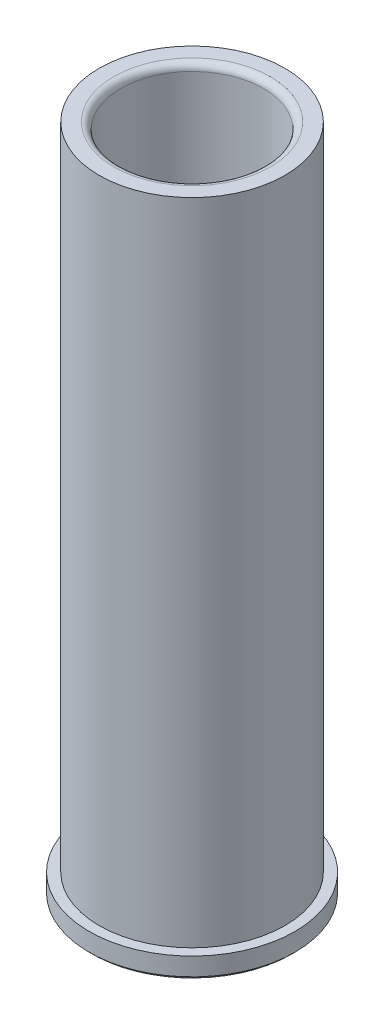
from build123d import *

# Parameters (mm, degrees)
FILLET1_R = 1.524


with BuildPart() as part:
    # Sketch1 → Revolve1 (revolve)
    with BuildSketch(Plane.XY, mode=Mode.PRIVATE) as revolve1_sk:
        Polygon((-22.1234, 0), (-22.8854, 0.762), (-22.8854, 4.7625), (-20.64385, 4.7625), (-20.64385, 149.225), (-15.88135, 149.225), (-15.88135, 0.762), (-16.64335, 0), align=None)
    revolve(revolve1_sk.sketch.rotate(Axis((0, -1000, 0), (0, 1, 0)), 180), axis=Axis((0, -1000, 0), (0, 1, 0)))

    # Fillet1
    fillet1_edges = [part.edges().sort_by_distance(p)[0] for p in [
        (-15.88135, 149.225, 0),
    ]]
    fillet(fillet1_edges, radius=FILLET1_R)


solid = part.part
